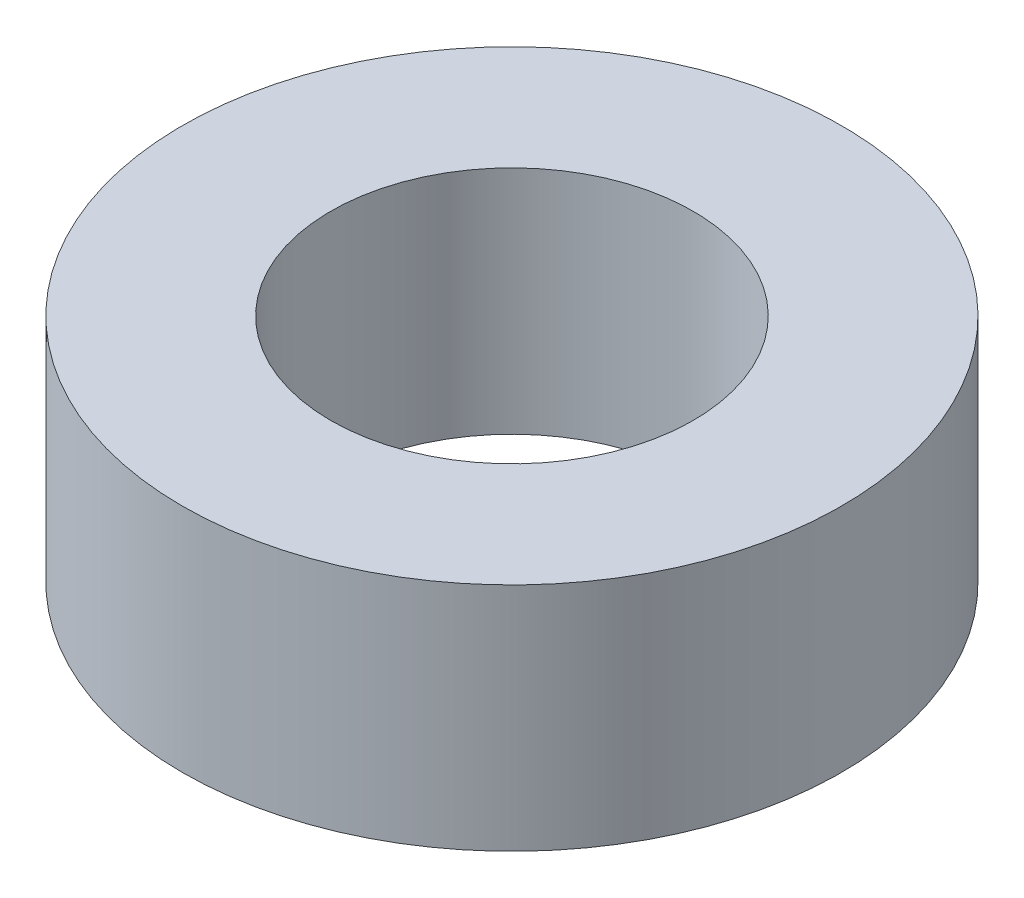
ISO-10303-21;
HEADER;
FILE_DESCRIPTION(('STEP AP214'),'2;1');
FILE_NAME('part.step','',(''),(''),'','','');
FILE_SCHEMA(('AUTOMOTIVE_DESIGN { 1 0 10303 214 1 1 1 1 }'));
ENDSEC;
DATA;
#1=APPLICATION_CONTEXT('core data for automotive mechanical design processes');
#2=APPLICATION_PROTOCOL_DEFINITION('international standard','automotive_design',2000,#1);
#3=PRODUCT_CONTEXT('',#1,'mechanical');
#4=PRODUCT('Part','Part','',(#3));
#5=PRODUCT_RELATED_PRODUCT_CATEGORY('part','',(#4));
#6=PRODUCT_DEFINITION_FORMATION('','',#4);
#7=PRODUCT_DEFINITION_CONTEXT('part definition',#1,'design');
#8=PRODUCT_DEFINITION('design','',#6,#7);
#9=PRODUCT_DEFINITION_SHAPE('','',#8);
#10=(LENGTH_UNIT() NAMED_UNIT(*) SI_UNIT(.MILLI.,.METRE.));
#11=(NAMED_UNIT(*) PLANE_ANGLE_UNIT() SI_UNIT($,.RADIAN.));
#12=(NAMED_UNIT(*) SI_UNIT($,.STERADIAN.) SOLID_ANGLE_UNIT());
#13=UNCERTAINTY_MEASURE_WITH_UNIT(LENGTH_MEASURE(1.E-05),#10,'distance_accuracy_value','');
#14=(GEOMETRIC_REPRESENTATION_CONTEXT(3) GLOBAL_UNCERTAINTY_ASSIGNED_CONTEXT((#13)) GLOBAL_UNIT_ASSIGNED_CONTEXT((#10,
#11,#12)) REPRESENTATION_CONTEXT('',''));
#15=CARTESIAN_POINT('',(0.,0.,0.));
#16=DIRECTION('',(0.,0.,1.));
#17=DIRECTION('',(1.,0.,0.));
#18=AXIS2_PLACEMENT_3D('',#15,#16,#17);
#19=CARTESIAN_POINT('',(0.,0.,0.));
#20=DIRECTION('',(0.,1.,0.));
#21=DIRECTION('',(0.,0.,1.));
#22=AXIS2_PLACEMENT_3D('',#19,#20,#21);
#23=CYLINDRICAL_SURFACE('',#22,3.3);
#24=CARTESIAN_POINT('',(0.,0.,0.));
#25=DIRECTION('',(0.,1.,0.));
#26=DIRECTION('',(0.,0.,1.));
#27=AXIS2_PLACEMENT_3D('',#24,#25,#26);
#28=CIRCLE('',#27,3.3);
#29=CARTESIAN_POINT('',(0.,0.,3.3));
#30=VERTEX_POINT('',#29);
#31=EDGE_CURVE('E17',#30,#30,#28,.F.);
#32=ORIENTED_EDGE('',*,*,#31,.T.);
#33=EDGE_LOOP('',(#32));
#34=FACE_BOUND('',#33,.T.);
#35=CARTESIAN_POINT('',(0.,4.19999999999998,0.));
#36=DIRECTION('',(0.,1.,0.));
#37=DIRECTION('',(0.,0.,1.));
#38=AXIS2_PLACEMENT_3D('',#35,#36,#37);
#39=CIRCLE('',#38,3.3);
#40=CARTESIAN_POINT('',(0.,4.19999999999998,3.3));
#41=VERTEX_POINT('',#40);
#42=EDGE_CURVE('E26',#41,#41,#39,.F.);
#43=ORIENTED_EDGE('',*,*,#42,.F.);
#44=EDGE_LOOP('',(#43));
#45=FACE_BOUND('',#44,.T.);
#46=ADVANCED_FACE('F14',(#34,#45),#23,.F.);
#47=CARTESIAN_POINT('',(0.,0.,0.));
#48=DIRECTION('',(0.,1.,0.));
#49=DIRECTION('',(0.,0.,1.));
#50=AXIS2_PLACEMENT_3D('',#47,#48,#49);
#51=PLANE('',#50);
#52=CARTESIAN_POINT('',(0.,0.,0.));
#53=DIRECTION('',(0.,1.,0.));
#54=DIRECTION('',(0.,0.,1.));
#55=AXIS2_PLACEMENT_3D('',#52,#53,#54);
#56=CIRCLE('',#55,6.);
#57=CARTESIAN_POINT('',(0.,0.,6.));
#58=VERTEX_POINT('',#57);
#59=EDGE_CURVE('E21',#58,#58,#56,.T.);
#60=ORIENTED_EDGE('',*,*,#59,.F.);
#61=EDGE_LOOP('',(#60));
#62=FACE_BOUND('',#61,.T.);
#63=ORIENTED_EDGE('',*,*,#31,.F.);
#64=EDGE_LOOP('',(#63));
#65=FACE_BOUND('',#64,.T.);
#66=ADVANCED_FACE('F36',(#62,#65),#51,.F.);
#67=CARTESIAN_POINT('',(0.,4.19999999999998,0.));
#68=DIRECTION('',(0.,1.,0.));
#69=DIRECTION('',(0.,0.,1.));
#70=AXIS2_PLACEMENT_3D('',#67,#68,#69);
#71=PLANE('',#70);
#72=CARTESIAN_POINT('',(0.,4.19999999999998,0.));
#73=DIRECTION('',(0.,1.,0.));
#74=DIRECTION('',(0.,0.,1.));
#75=AXIS2_PLACEMENT_3D('',#72,#73,#74);
#76=CIRCLE('',#75,6.);
#77=CARTESIAN_POINT('',(0.,4.19999999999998,6.));
#78=VERTEX_POINT('',#77);
#79=EDGE_CURVE('E10',#78,#78,#76,.F.);
#80=ORIENTED_EDGE('',*,*,#79,.F.);
#81=EDGE_LOOP('',(#80));
#82=FACE_BOUND('',#81,.T.);
#83=ORIENTED_EDGE('',*,*,#42,.T.);
#84=EDGE_LOOP('',(#83));
#85=FACE_BOUND('',#84,.T.);
#86=ADVANCED_FACE('F38',(#82,#85),#71,.T.);
#87=CARTESIAN_POINT('',(0.,0.,0.));
#88=DIRECTION('',(0.,1.,0.));
#89=DIRECTION('',(0.,0.,1.));
#90=AXIS2_PLACEMENT_3D('',#87,#88,#89);
#91=CYLINDRICAL_SURFACE('',#90,6.);
#92=ORIENTED_EDGE('',*,*,#79,.T.);
#93=EDGE_LOOP('',(#92));
#94=FACE_BOUND('',#93,.T.);
#95=ORIENTED_EDGE('',*,*,#59,.T.);
#96=EDGE_LOOP('',(#95));
#97=FACE_BOUND('',#96,.T.);
#98=ADVANCED_FACE('F45',(#94,#97),#91,.T.);
#99=CLOSED_SHELL('',(#46,#66,#86,#98));
#100=MANIFOLD_SOLID_BREP('B1',#99);
#101=ADVANCED_BREP_SHAPE_REPRESENTATION('',(#18,#100),#14);
#102=SHAPE_DEFINITION_REPRESENTATION(#9,#101);
ENDSEC;
END-ISO-10303-21;
